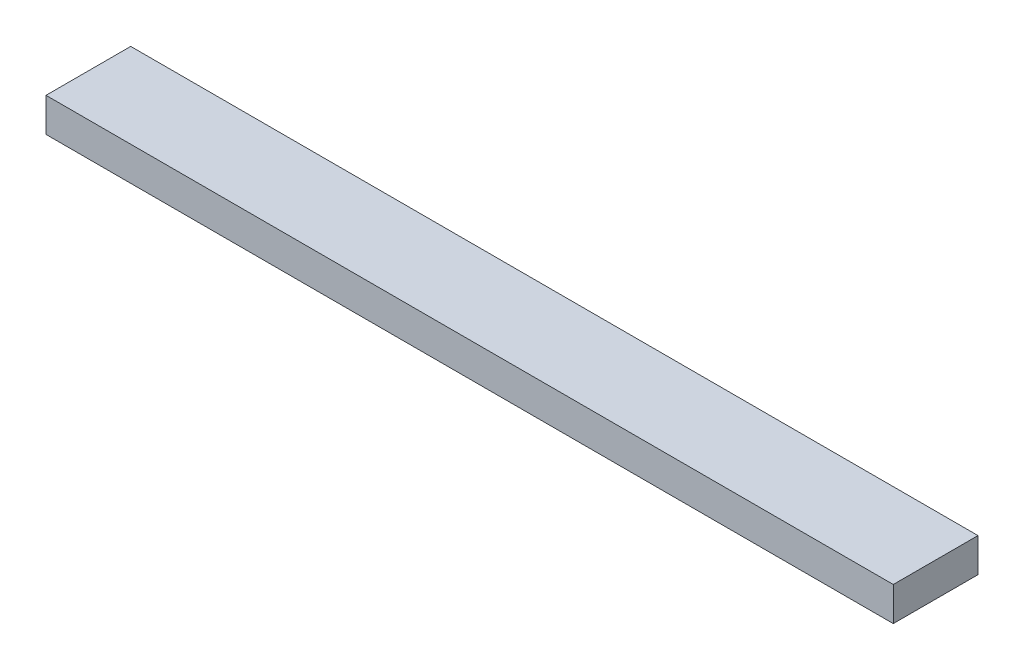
from build123d import *

# Parameters (mm, degrees)
SKIZZE1_W                       = 500
SKIZZE1_H                       = 50
AUFSATZ_LINEAR_AUSTRAGEN1_DEPTH = 20


with BuildPart() as part:
    # Skizze1 → Aufsatz-Linear austragen1 (new body)
    with BuildSketch(Plane(origin=(0, 0, 0), x_dir=(1, 0, 0), z_dir=(0, 1, 0))):
        with Locations((0, -25)):
            Rectangle(SKIZZE1_W, SKIZZE1_H)
    extrude(amount=-AUFSATZ_LINEAR_AUSTRAGEN1_DEPTH)


solid = part.part
